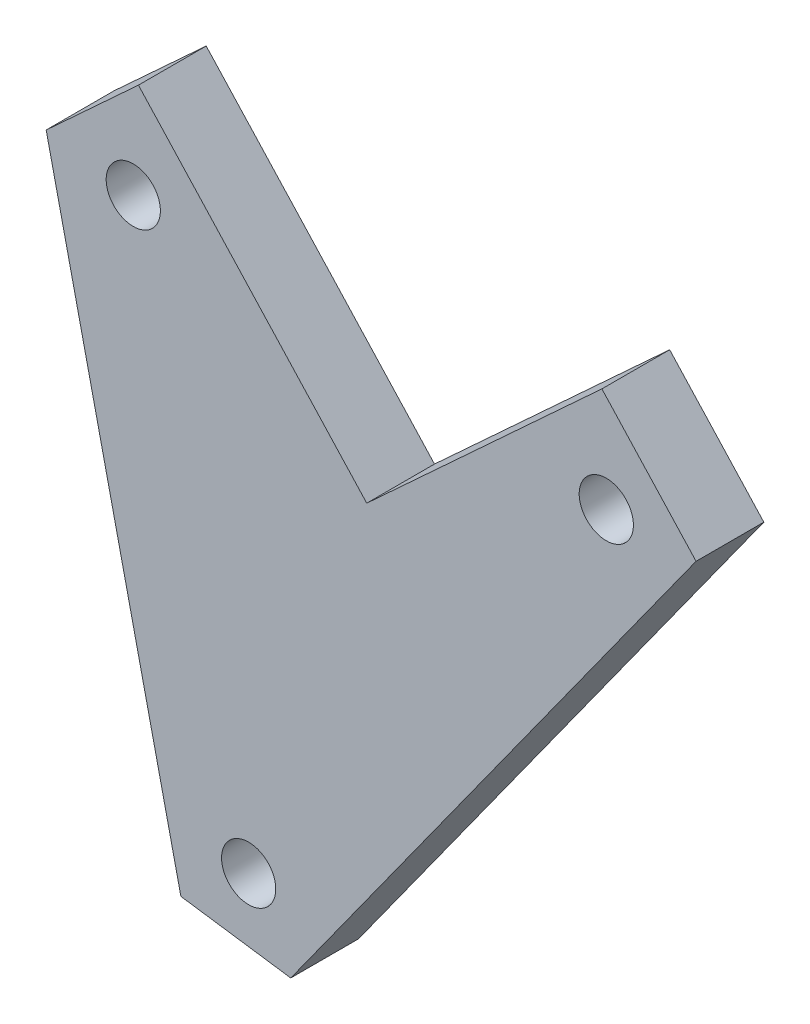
ISO-10303-21;
HEADER;
FILE_DESCRIPTION(('STEP AP214'),'2;1');
FILE_NAME('part.step','',(''),(''),'','','');
FILE_SCHEMA(('AUTOMOTIVE_DESIGN { 1 0 10303 214 1 1 1 1 }'));
ENDSEC;
DATA;
#1=APPLICATION_CONTEXT('core data for automotive mechanical design processes');
#2=APPLICATION_PROTOCOL_DEFINITION('international standard','automotive_design',2000,#1);
#3=PRODUCT_CONTEXT('',#1,'mechanical');
#4=PRODUCT('Part','Part','',(#3));
#5=PRODUCT_RELATED_PRODUCT_CATEGORY('part','',(#4));
#6=PRODUCT_DEFINITION_FORMATION('','',#4);
#7=PRODUCT_DEFINITION_CONTEXT('part definition',#1,'design');
#8=PRODUCT_DEFINITION('design','',#6,#7);
#9=PRODUCT_DEFINITION_SHAPE('','',#8);
#10=(LENGTH_UNIT() NAMED_UNIT(*) SI_UNIT(.MILLI.,.METRE.));
#11=(NAMED_UNIT(*) PLANE_ANGLE_UNIT() SI_UNIT($,.RADIAN.));
#12=(NAMED_UNIT(*) SI_UNIT($,.STERADIAN.) SOLID_ANGLE_UNIT());
#13=UNCERTAINTY_MEASURE_WITH_UNIT(LENGTH_MEASURE(1.E-05),#10,'distance_accuracy_value','');
#14=(GEOMETRIC_REPRESENTATION_CONTEXT(3) GLOBAL_UNCERTAINTY_ASSIGNED_CONTEXT((#13)) GLOBAL_UNIT_ASSIGNED_CONTEXT((#10,
#11,#12)) REPRESENTATION_CONTEXT('',''));
#15=CARTESIAN_POINT('',(0.,0.,0.));
#16=DIRECTION('',(0.,0.,1.));
#17=DIRECTION('',(1.,0.,0.));
#18=AXIS2_PLACEMENT_3D('',#15,#16,#17);
#19=CARTESIAN_POINT('',(0.,0.,6.35));
#20=DIRECTION('',(0.,0.,-1.));
#21=DIRECTION('',(-1.,0.,0.));
#22=AXIS2_PLACEMENT_3D('',#19,#20,#21);
#23=PLANE('',#22);
#24=CARTESIAN_POINT('',(33.514297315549,46.2916231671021,6.35));
#25=DIRECTION('',(0.,0.,1.));
#26=DIRECTION('',(1.,0.,0.));
#27=AXIS2_PLACEMENT_3D('',#24,#25,#26);
#28=CIRCLE('',#27,2.54);
#29=CARTESIAN_POINT('',(36.054297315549,46.2916231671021,6.35));
#30=VERTEX_POINT('',#29);
#31=EDGE_CURVE('E164',#30,#30,#28,.T.);
#32=ORIENTED_EDGE('',*,*,#31,.F.);
#33=EDGE_LOOP('',(#32));
#34=FACE_BOUND('',#33,.T.);
#35=DIRECTION('',(0.989879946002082,-0.141907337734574,0.));
#36=VECTOR('',#35,1.);
#37=CARTESIAN_POINT('',(-6.34961495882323,-5.04046796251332,6.35));
#38=LINE('',#37,#36);
#39=CARTESIAN_POINT('',(-6.34961495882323,-5.04046796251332,6.35));
#40=VERTEX_POINT('',#39);
#41=CARTESIAN_POINT('',(3.94269773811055,-6.51595466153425,6.35));
#42=VERTEX_POINT('',#41);
#43=EDGE_CURVE('E137',#40,#42,#38,.T.);
#44=ORIENTED_EDGE('',*,*,#43,.T.);
#45=DIRECTION('',(0.583912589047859,0.811816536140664,0.));
#46=VECTOR('',#45,1.);
#47=CARTESIAN_POINT('',(3.94269773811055,-6.51595466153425,6.35));
#48=LINE('',#47,#46);
#49=CARTESIAN_POINT('',(41.9254292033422,46.2916231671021,6.35));
#50=VERTEX_POINT('',#49);
#51=EDGE_CURVE('E90',#42,#50,#48,.T.);
#52=ORIENTED_EDGE('',*,*,#51,.T.);
#53=DIRECTION('',(-0.677427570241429,0.735589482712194,0.));
#54=VECTOR('',#53,1.);
#55=CARTESIAN_POINT('',(41.9254292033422,46.2916231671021,6.35));
#56=LINE('',#55,#54);
#57=CARTESIAN_POINT('',(33.1020783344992,55.8725206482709,6.35));
#58=VERTEX_POINT('',#57);
#59=EDGE_CURVE('E149',#50,#58,#56,.T.);
#60=ORIENTED_EDGE('',*,*,#59,.T.);
#61=DIRECTION('',(-0.735589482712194,-0.677427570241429,0.));
#62=VECTOR('',#61,1.);
#63=CARTESIAN_POINT('',(33.1020783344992,55.8725206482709,6.35));
#64=LINE('',#63,#62);
#65=CARTESIAN_POINT('',(11.0653067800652,35.5781622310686,6.35));
#66=VERTEX_POINT('',#65);
#67=EDGE_CURVE('E106',#58,#66,#64,.T.);
#68=ORIENTED_EDGE('',*,*,#67,.T.);
#69=DIRECTION('',(-0.677427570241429,0.735589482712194,0.));
#70=VECTOR('',#69,1.);
#71=CARTESIAN_POINT('',(11.0653067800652,35.5781622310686,6.35));
#72=LINE('',#71,#70);
#73=CARTESIAN_POINT('',(-10.3274306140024,58.8076163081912,6.35));
#74=VERTEX_POINT('',#73);
#75=EDGE_CURVE('E100',#66,#74,#72,.T.);
#76=ORIENTED_EDGE('',*,*,#75,.T.);
#77=DIRECTION('',(-0.735589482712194,-0.677427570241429,0.));
#78=VECTOR('',#77,1.);
#79=CARTESIAN_POINT('',(-10.3274306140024,58.8076163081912,6.35));
#80=LINE('',#79,#78);
#81=CARTESIAN_POINT('',(-18.9729669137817,50.8456690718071,6.35));
#82=VERTEX_POINT('',#81);
#83=EDGE_CURVE('E104',#74,#82,#80,.T.);
#84=ORIENTED_EDGE('',*,*,#83,.T.);
#85=DIRECTION('',(0.220325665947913,-0.975426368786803,0.));
#86=VECTOR('',#85,1.);
#87=CARTESIAN_POINT('',(-18.9729669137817,50.8456690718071,6.35));
#88=LINE('',#87,#86);
#89=EDGE_CURVE('E50',#82,#40,#88,.T.);
#90=ORIENTED_EDGE('',*,*,#89,.T.);
#91=EDGE_LOOP('',(#44,#52,#60,#68,#76,#84,#90));
#92=FACE_BOUND('',#91,.T.);
#93=CARTESIAN_POINT('',(-10.8096656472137,49.6365906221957,6.35));
#94=DIRECTION('',(0.,0.,1.));
#95=DIRECTION('',(1.,0.,0.));
#96=AXIS2_PLACEMENT_3D('',#93,#94,#95);
#97=CIRCLE('',#96,2.54);
#98=CARTESIAN_POINT('',(-8.26966564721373,49.6365906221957,6.35));
#99=VERTEX_POINT('',#98);
#100=EDGE_CURVE('E128',#99,#99,#97,.T.);
#101=ORIENTED_EDGE('',*,*,#100,.F.);
#102=EDGE_LOOP('',(#101));
#103=FACE_BOUND('',#102,.T.);
#104=CARTESIAN_POINT('',(0.,0.,6.35));
#105=DIRECTION('',(0.,0.,1.));
#106=DIRECTION('',(1.,0.,0.));
#107=AXIS2_PLACEMENT_3D('',#104,#105,#106);
#108=CIRCLE('',#107,2.54);
#109=CARTESIAN_POINT('',(2.54,0.,6.35));
#110=VERTEX_POINT('',#109);
#111=EDGE_CURVE('E170',#110,#110,#108,.T.);
#112=ORIENTED_EDGE('',*,*,#111,.F.);
#113=EDGE_LOOP('',(#112));
#114=FACE_BOUND('',#113,.T.);
#115=ADVANCED_FACE('F33',(#34,#92,#103,#114),#23,.F.);
#116=CARTESIAN_POINT('',(0.,0.,0.));
#117=DIRECTION('',(0.,0.,-1.));
#118=DIRECTION('',(-1.,0.,0.));
#119=AXIS2_PLACEMENT_3D('',#116,#117,#118);
#120=PLANE('',#119);
#121=CARTESIAN_POINT('',(33.514297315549,46.2916231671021,0.));
#122=DIRECTION('',(0.,0.,1.));
#123=DIRECTION('',(1.,0.,0.));
#124=AXIS2_PLACEMENT_3D('',#121,#122,#123);
#125=CIRCLE('',#124,2.54);
#126=CARTESIAN_POINT('',(36.054297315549,46.2916231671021,0.));
#127=VERTEX_POINT('',#126);
#128=EDGE_CURVE('E167',#127,#127,#125,.T.);
#129=ORIENTED_EDGE('',*,*,#128,.T.);
#130=EDGE_LOOP('',(#129));
#131=FACE_BOUND('',#130,.T.);
#132=DIRECTION('',(0.989879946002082,-0.141907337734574,0.));
#133=VECTOR('',#132,1.);
#134=CARTESIAN_POINT('',(-6.34961495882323,-5.04046796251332,0.));
#135=LINE('',#134,#133);
#136=CARTESIAN_POINT('',(-6.34961495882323,-5.04046796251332,0.));
#137=VERTEX_POINT('',#136);
#138=CARTESIAN_POINT('',(3.94269773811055,-6.51595466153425,0.));
#139=VERTEX_POINT('',#138);
#140=EDGE_CURVE('E124',#137,#139,#135,.T.);
#141=ORIENTED_EDGE('',*,*,#140,.F.);
#142=DIRECTION('',(0.220325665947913,-0.975426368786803,0.));
#143=VECTOR('',#142,1.);
#144=CARTESIAN_POINT('',(-18.9729669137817,50.8456690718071,0.));
#145=LINE('',#144,#143);
#146=CARTESIAN_POINT('',(-18.9729669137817,50.8456690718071,0.));
#147=VERTEX_POINT('',#146);
#148=EDGE_CURVE('E82',#147,#137,#145,.T.);
#149=ORIENTED_EDGE('',*,*,#148,.F.);
#150=DIRECTION('',(-0.735589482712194,-0.677427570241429,0.));
#151=VECTOR('',#150,1.);
#152=CARTESIAN_POINT('',(-10.3274306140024,58.8076163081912,0.));
#153=LINE('',#152,#151);
#154=CARTESIAN_POINT('',(-10.3274306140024,58.8076163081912,0.));
#155=VERTEX_POINT('',#154);
#156=EDGE_CURVE('E76',#155,#147,#153,.T.);
#157=ORIENTED_EDGE('',*,*,#156,.F.);
#158=DIRECTION('',(-0.677427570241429,0.735589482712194,0.));
#159=VECTOR('',#158,1.);
#160=CARTESIAN_POINT('',(11.0653067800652,35.5781622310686,0.));
#161=LINE('',#160,#159);
#162=CARTESIAN_POINT('',(11.0653067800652,35.5781622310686,0.));
#163=VERTEX_POINT('',#162);
#164=EDGE_CURVE('E114',#163,#155,#161,.T.);
#165=ORIENTED_EDGE('',*,*,#164,.F.);
#166=DIRECTION('',(-0.735589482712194,-0.677427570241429,0.));
#167=VECTOR('',#166,1.);
#168=CARTESIAN_POINT('',(33.1020783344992,55.8725206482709,0.));
#169=LINE('',#168,#167);
#170=CARTESIAN_POINT('',(33.1020783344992,55.8725206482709,0.));
#171=VERTEX_POINT('',#170);
#172=EDGE_CURVE('E132',#171,#163,#169,.T.);
#173=ORIENTED_EDGE('',*,*,#172,.F.);
#174=DIRECTION('',(-0.677427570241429,0.735589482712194,0.));
#175=VECTOR('',#174,1.);
#176=CARTESIAN_POINT('',(41.9254292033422,46.2916231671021,0.));
#177=LINE('',#176,#175);
#178=CARTESIAN_POINT('',(41.9254292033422,46.2916231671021,0.));
#179=VERTEX_POINT('',#178);
#180=EDGE_CURVE('E130',#179,#171,#177,.T.);
#181=ORIENTED_EDGE('',*,*,#180,.F.);
#182=DIRECTION('',(0.583912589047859,0.811816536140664,0.));
#183=VECTOR('',#182,1.);
#184=CARTESIAN_POINT('',(3.94269773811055,-6.51595466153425,0.));
#185=LINE('',#184,#183);
#186=EDGE_CURVE('E127',#139,#179,#185,.T.);
#187=ORIENTED_EDGE('',*,*,#186,.F.);
#188=EDGE_LOOP('',(#141,#149,#157,#165,#173,#181,#187));
#189=FACE_BOUND('',#188,.T.);
#190=CARTESIAN_POINT('',(-10.8096656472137,49.6365906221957,0.));
#191=DIRECTION('',(0.,0.,1.));
#192=DIRECTION('',(1.,0.,0.));
#193=AXIS2_PLACEMENT_3D('',#190,#191,#192);
#194=CIRCLE('',#193,2.54);
#195=CARTESIAN_POINT('',(-8.26966564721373,49.6365906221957,0.));
#196=VERTEX_POINT('',#195);
#197=EDGE_CURVE('E161',#196,#196,#194,.T.);
#198=ORIENTED_EDGE('',*,*,#197,.T.);
#199=EDGE_LOOP('',(#198));
#200=FACE_BOUND('',#199,.T.);
#201=CARTESIAN_POINT('',(0.,0.,0.));
#202=DIRECTION('',(0.,0.,1.));
#203=DIRECTION('',(1.,0.,0.));
#204=AXIS2_PLACEMENT_3D('',#201,#202,#203);
#205=CIRCLE('',#204,2.54);
#206=CARTESIAN_POINT('',(2.54,0.,0.));
#207=VERTEX_POINT('',#206);
#208=EDGE_CURVE('E173',#207,#207,#205,.T.);
#209=ORIENTED_EDGE('',*,*,#208,.T.);
#210=EDGE_LOOP('',(#209));
#211=FACE_BOUND('',#210,.T.);
#212=ADVANCED_FACE('F153',(#131,#189,#200,#211),#120,.T.);
#213=CARTESIAN_POINT('',(-6.34961495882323,-5.04046796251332,6.35));
#214=DIRECTION('',(0.141907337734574,0.989879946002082,0.));
#215=DIRECTION('',(-0.989879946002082,0.141907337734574,0.));
#216=AXIS2_PLACEMENT_3D('',#213,#214,#215);
#217=PLANE('',#216);
#218=ORIENTED_EDGE('',*,*,#140,.T.);
#219=DIRECTION('',(0.,0.,-1.));
#220=VECTOR('',#219,1.);
#221=CARTESIAN_POINT('',(3.94269773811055,-6.51595466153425,6.35));
#222=LINE('',#221,#220);
#223=EDGE_CURVE('E11',#42,#139,#222,.T.);
#224=ORIENTED_EDGE('',*,*,#223,.F.);
#225=ORIENTED_EDGE('',*,*,#43,.F.);
#226=DIRECTION('',(0.,0.,-1.));
#227=VECTOR('',#226,1.);
#228=CARTESIAN_POINT('',(-6.34961495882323,-5.04046796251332,6.35));
#229=LINE('',#228,#227);
#230=EDGE_CURVE('E120',#40,#137,#229,.T.);
#231=ORIENTED_EDGE('',*,*,#230,.T.);
#232=EDGE_LOOP('',(#218,#224,#225,#231));
#233=FACE_BOUND('',#232,.T.);
#234=ADVANCED_FACE('F35',(#233),#217,.F.);
#235=CARTESIAN_POINT('',(3.94269773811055,-6.51595466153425,6.35));
#236=DIRECTION('',(-0.811816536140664,0.583912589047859,0.));
#237=DIRECTION('',(-0.583912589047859,-0.811816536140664,0.));
#238=AXIS2_PLACEMENT_3D('',#235,#236,#237);
#239=PLANE('',#238);
#240=ORIENTED_EDGE('',*,*,#186,.T.);
#241=DIRECTION('',(0.,0.,-1.));
#242=VECTOR('',#241,1.);
#243=CARTESIAN_POINT('',(41.9254292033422,46.2916231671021,6.35));
#244=LINE('',#243,#242);
#245=EDGE_CURVE('E42',#50,#179,#244,.T.);
#246=ORIENTED_EDGE('',*,*,#245,.F.);
#247=ORIENTED_EDGE('',*,*,#51,.F.);
#248=ORIENTED_EDGE('',*,*,#223,.T.);
#249=EDGE_LOOP('',(#240,#246,#247,#248));
#250=FACE_BOUND('',#249,.T.);
#251=ADVANCED_FACE('F205',(#250),#239,.F.);
#252=CARTESIAN_POINT('',(41.9254292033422,46.2916231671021,6.35));
#253=DIRECTION('',(-0.735589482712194,-0.677427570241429,0.));
#254=DIRECTION('',(0.677427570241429,-0.735589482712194,0.));
#255=AXIS2_PLACEMENT_3D('',#252,#253,#254);
#256=PLANE('',#255);
#257=ORIENTED_EDGE('',*,*,#180,.T.);
#258=DIRECTION('',(0.,0.,-1.));
#259=VECTOR('',#258,1.);
#260=CARTESIAN_POINT('',(33.1020783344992,55.8725206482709,6.35));
#261=LINE('',#260,#259);
#262=EDGE_CURVE('E141',#58,#171,#261,.T.);
#263=ORIENTED_EDGE('',*,*,#262,.F.);
#264=ORIENTED_EDGE('',*,*,#59,.F.);
#265=ORIENTED_EDGE('',*,*,#245,.T.);
#266=EDGE_LOOP('',(#257,#263,#264,#265));
#267=FACE_BOUND('',#266,.T.);
#268=ADVANCED_FACE('F147',(#267),#256,.F.);
#269=CARTESIAN_POINT('',(33.1020783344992,55.8725206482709,6.35));
#270=DIRECTION('',(0.677427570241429,-0.735589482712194,0.));
#271=DIRECTION('',(0.735589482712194,0.677427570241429,0.));
#272=AXIS2_PLACEMENT_3D('',#269,#270,#271);
#273=PLANE('',#272);
#274=ORIENTED_EDGE('',*,*,#172,.T.);
#275=DIRECTION('',(0.,0.,-1.));
#276=VECTOR('',#275,1.);
#277=CARTESIAN_POINT('',(11.0653067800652,35.5781622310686,6.35));
#278=LINE('',#277,#276);
#279=EDGE_CURVE('E115',#66,#163,#278,.T.);
#280=ORIENTED_EDGE('',*,*,#279,.F.);
#281=ORIENTED_EDGE('',*,*,#67,.F.);
#282=ORIENTED_EDGE('',*,*,#262,.T.);
#283=EDGE_LOOP('',(#274,#280,#281,#282));
#284=FACE_BOUND('',#283,.T.);
#285=ADVANCED_FACE('F156',(#284),#273,.F.);
#286=CARTESIAN_POINT('',(11.0653067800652,35.5781622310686,6.35));
#287=DIRECTION('',(-0.735589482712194,-0.677427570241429,0.));
#288=DIRECTION('',(0.677427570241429,-0.735589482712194,0.));
#289=AXIS2_PLACEMENT_3D('',#286,#287,#288);
#290=PLANE('',#289);
#291=ORIENTED_EDGE('',*,*,#164,.T.);
#292=DIRECTION('',(0.,0.,-1.));
#293=VECTOR('',#292,1.);
#294=CARTESIAN_POINT('',(-10.3274306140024,58.8076163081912,6.35));
#295=LINE('',#294,#293);
#296=EDGE_CURVE('E111',#74,#155,#295,.T.);
#297=ORIENTED_EDGE('',*,*,#296,.F.);
#298=ORIENTED_EDGE('',*,*,#75,.F.);
#299=ORIENTED_EDGE('',*,*,#279,.T.);
#300=EDGE_LOOP('',(#291,#297,#298,#299));
#301=FACE_BOUND('',#300,.T.);
#302=ADVANCED_FACE('F112',(#301),#290,.F.);
#303=CARTESIAN_POINT('',(-10.3274306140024,58.8076163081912,6.35));
#304=DIRECTION('',(0.677427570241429,-0.735589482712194,0.));
#305=DIRECTION('',(0.735589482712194,0.677427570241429,0.));
#306=AXIS2_PLACEMENT_3D('',#303,#304,#305);
#307=PLANE('',#306);
#308=ORIENTED_EDGE('',*,*,#156,.T.);
#309=DIRECTION('',(0.,0.,-1.));
#310=VECTOR('',#309,1.);
#311=CARTESIAN_POINT('',(-18.9729669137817,50.8456690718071,6.35));
#312=LINE('',#311,#310);
#313=EDGE_CURVE('E116',#82,#147,#312,.T.);
#314=ORIENTED_EDGE('',*,*,#313,.F.);
#315=ORIENTED_EDGE('',*,*,#83,.F.);
#316=ORIENTED_EDGE('',*,*,#296,.T.);
#317=EDGE_LOOP('',(#308,#314,#315,#316));
#318=FACE_BOUND('',#317,.T.);
#319=ADVANCED_FACE('F118',(#318),#307,.F.);
#320=CARTESIAN_POINT('',(-18.9729669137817,50.8456690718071,6.35));
#321=DIRECTION('',(0.975426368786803,0.220325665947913,0.));
#322=DIRECTION('',(-0.220325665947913,0.975426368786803,0.));
#323=AXIS2_PLACEMENT_3D('',#320,#321,#322);
#324=PLANE('',#323);
#325=ORIENTED_EDGE('',*,*,#148,.T.);
#326=ORIENTED_EDGE('',*,*,#230,.F.);
#327=ORIENTED_EDGE('',*,*,#89,.F.);
#328=ORIENTED_EDGE('',*,*,#313,.T.);
#329=EDGE_LOOP('',(#325,#326,#327,#328));
#330=FACE_BOUND('',#329,.T.);
#331=ADVANCED_FACE('F195',(#330),#324,.F.);
#332=CARTESIAN_POINT('',(-10.8096656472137,49.6365906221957,6.35));
#333=DIRECTION('',(0.,0.,-1.));
#334=DIRECTION('',(-1.,0.,0.));
#335=AXIS2_PLACEMENT_3D('',#332,#333,#334);
#336=CYLINDRICAL_SURFACE('',#335,2.54);
#337=ORIENTED_EDGE('',*,*,#100,.T.);
#338=EDGE_LOOP('',(#337));
#339=FACE_BOUND('',#338,.T.);
#340=ORIENTED_EDGE('',*,*,#197,.F.);
#341=EDGE_LOOP('',(#340));
#342=FACE_BOUND('',#341,.T.);
#343=ADVANCED_FACE('F192',(#339,#342),#336,.F.);
#344=CARTESIAN_POINT('',(33.514297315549,46.2916231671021,6.35));
#345=DIRECTION('',(0.,0.,-1.));
#346=DIRECTION('',(-1.,0.,0.));
#347=AXIS2_PLACEMENT_3D('',#344,#345,#346);
#348=CYLINDRICAL_SURFACE('',#347,2.54);
#349=ORIENTED_EDGE('',*,*,#31,.T.);
#350=EDGE_LOOP('',(#349));
#351=FACE_BOUND('',#350,.T.);
#352=ORIENTED_EDGE('',*,*,#128,.F.);
#353=EDGE_LOOP('',(#352));
#354=FACE_BOUND('',#353,.T.);
#355=ADVANCED_FACE('F264',(#351,#354),#348,.F.);
#356=CARTESIAN_POINT('',(0.,0.,6.35));
#357=DIRECTION('',(0.,0.,-1.));
#358=DIRECTION('',(-1.,0.,0.));
#359=AXIS2_PLACEMENT_3D('',#356,#357,#358);
#360=CYLINDRICAL_SURFACE('',#359,2.54);
#361=ORIENTED_EDGE('',*,*,#111,.T.);
#362=EDGE_LOOP('',(#361));
#363=FACE_BOUND('',#362,.T.);
#364=ORIENTED_EDGE('',*,*,#208,.F.);
#365=EDGE_LOOP('',(#364));
#366=FACE_BOUND('',#365,.T.);
#367=ADVANCED_FACE('F179',(#363,#366),#360,.F.);
#368=CLOSED_SHELL('',(#115,#212,#234,#251,#268,#285,#302,#319,#331,#343,#355,#367));
#369=MANIFOLD_SOLID_BREP('B2',#368);
#370=ADVANCED_BREP_SHAPE_REPRESENTATION('',(#18,#369),#14);
#371=SHAPE_DEFINITION_REPRESENTATION(#9,#370);
ENDSEC;
END-ISO-10303-21;
